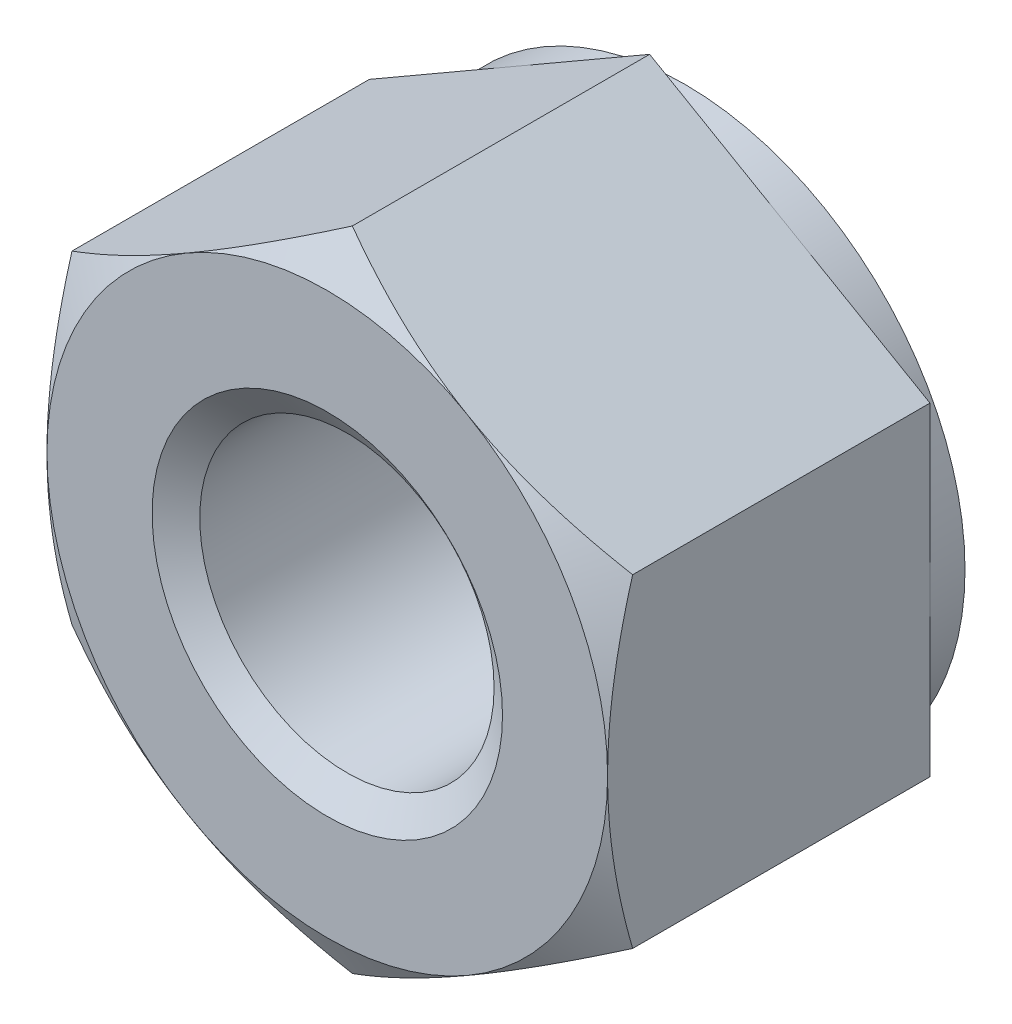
ISO-10303-21;
HEADER;
FILE_DESCRIPTION(('STEP AP214'),'2;1');
FILE_NAME('part.step','',(''),(''),'','','');
FILE_SCHEMA(('AUTOMOTIVE_DESIGN { 1 0 10303 214 1 1 1 1 }'));
ENDSEC;
DATA;
#1=APPLICATION_CONTEXT('core data for automotive mechanical design processes');
#2=APPLICATION_PROTOCOL_DEFINITION('international standard','automotive_design',2000,#1);
#3=PRODUCT_CONTEXT('',#1,'mechanical');
#4=PRODUCT('Part','Part','',(#3));
#5=PRODUCT_RELATED_PRODUCT_CATEGORY('part','',(#4));
#6=PRODUCT_DEFINITION_FORMATION('','',#4);
#7=PRODUCT_DEFINITION_CONTEXT('part definition',#1,'design');
#8=PRODUCT_DEFINITION('design','',#6,#7);
#9=PRODUCT_DEFINITION_SHAPE('','',#8);
#10=(LENGTH_UNIT() NAMED_UNIT(*) SI_UNIT(.MILLI.,.METRE.));
#11=(NAMED_UNIT(*) PLANE_ANGLE_UNIT() SI_UNIT($,.RADIAN.));
#12=(NAMED_UNIT(*) SI_UNIT($,.STERADIAN.) SOLID_ANGLE_UNIT());
#13=UNCERTAINTY_MEASURE_WITH_UNIT(LENGTH_MEASURE(1.E-05),#10,'distance_accuracy_value','');
#14=(GEOMETRIC_REPRESENTATION_CONTEXT(3) GLOBAL_UNCERTAINTY_ASSIGNED_CONTEXT((#13)) GLOBAL_UNIT_ASSIGNED_CONTEXT((#10,
#11,#12)) REPRESENTATION_CONTEXT('',''));
#15=CARTESIAN_POINT('',(0.,0.,0.));
#16=DIRECTION('',(0.,0.,1.));
#17=DIRECTION('',(1.,0.,0.));
#18=AXIS2_PLACEMENT_3D('',#15,#16,#17);
#19=CARTESIAN_POINT('',(0.,0.,-5.1));
#20=DIRECTION('',(0.,0.,1.));
#21=DIRECTION('',(1.,0.,0.));
#22=AXIS2_PLACEMENT_3D('',#19,#20,#21);
#23=CYLINDRICAL_SURFACE('',#22,2.1);
#24=CARTESIAN_POINT('',(0.,0.,-0.28008301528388));
#25=DIRECTION('',(0.,0.,1.));
#26=DIRECTION('',(1.,0.,0.));
#27=AXIS2_PLACEMENT_3D('',#24,#25,#26);
#28=CIRCLE('',#27,2.1);
#29=CARTESIAN_POINT('',(2.1,0.,-0.28008301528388));
#30=VERTEX_POINT('',#29);
#31=EDGE_CURVE('E153',#30,#30,#28,.F.);
#32=ORIENTED_EDGE('',*,*,#31,.F.);
#33=EDGE_LOOP('',(#32));
#34=FACE_BOUND('',#33,.T.);
#35=CARTESIAN_POINT('',(0.,0.,-4.79451698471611));
#36=DIRECTION('',(0.,0.,-1.));
#37=DIRECTION('',(-1.,0.,0.));
#38=AXIS2_PLACEMENT_3D('',#35,#36,#37);
#39=CIRCLE('',#38,2.1);
#40=CARTESIAN_POINT('',(-2.1,0.,-4.79451698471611));
#41=VERTEX_POINT('',#40);
#42=EDGE_CURVE('E41',#41,#41,#39,.F.);
#43=ORIENTED_EDGE('',*,*,#42,.F.);
#44=EDGE_LOOP('',(#43));
#45=FACE_BOUND('',#44,.T.);
#46=ADVANCED_FACE('F36',(#34,#45),#23,.F.);
#47=CARTESIAN_POINT('',(0.,4.61880215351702,-5.1));
#48=DIRECTION('',(-0.500000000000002,0.866025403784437,0.));
#49=DIRECTION('',(-0.866025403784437,-0.500000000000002,0.));
#50=AXIS2_PLACEMENT_3D('',#47,#48,#49);
#51=PLANE('',#50);
#52=DIRECTION('',(0.,0.,1.));
#53=VECTOR('',#52,1.);
#54=CARTESIAN_POINT('',(-4.,2.3094010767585,-5.1));
#55=LINE('',#54,#53);
#56=CARTESIAN_POINT('',(-4.,2.3094010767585,-4.6));
#57=VERTEX_POINT('',#56);
#58=CARTESIAN_POINT('',(-4.,2.3094010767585,-0.357265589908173));
#59=VERTEX_POINT('',#58);
#60=EDGE_CURVE('E294',#57,#59,#55,.T.);
#61=ORIENTED_EDGE('',*,*,#60,.T.);
#62=CARTESIAN_POINT('',(-4.0002,2.30928560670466,-0.357332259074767));
#63=CARTESIAN_POINT('',(-3.82442084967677,2.4107717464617,-0.298717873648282));
#64=CARTESIAN_POINT('',(-3.64712438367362,2.51313390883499,-0.245410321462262));
#65=CARTESIAN_POINT('',(-3.28946140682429,2.71963072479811,-0.152361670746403));
#66=CARTESIAN_POINT('',(-3.10908854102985,2.82376904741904,-0.112653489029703));
#67=CARTESIAN_POINT('',(-2.75057818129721,3.03075510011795,-0.0508422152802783));
#68=CARTESIAN_POINT('',(-2.57249584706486,3.13357098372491,-0.028327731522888));
#69=CARTESIAN_POINT('',(-2.21549328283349,3.33968651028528,-0.00145062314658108));
#70=CARTESIAN_POINT('',(-2.0365743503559,3.44298540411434,0.00293425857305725));
#71=CARTESIAN_POINT('',(-1.70225715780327,3.63600352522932,-0.0061900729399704));
#72=CARTESIAN_POINT('',(-1.54680884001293,3.72575165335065,-0.0174589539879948));
#73=CARTESIAN_POINT('',(-1.23692494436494,3.90466320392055,-0.0531739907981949));
#74=CARTESIAN_POINT('',(-1.08249043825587,3.99382600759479,-0.0776323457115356));
#75=CARTESIAN_POINT('',(-0.771967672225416,4.17310641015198,-0.138776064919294));
#76=CARTESIAN_POINT('',(-0.61591871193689,4.26320131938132,-0.175720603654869));
#77=CARTESIAN_POINT('',(-0.306148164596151,4.44204742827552,-0.259570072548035));
#78=CARTESIAN_POINT('',(-0.15242260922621,4.53080091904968,-0.306455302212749));
#79=CARTESIAN_POINT('',(0.000200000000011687,4.61891762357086,-0.357332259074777));
#80=B_SPLINE_CURVE_WITH_KNOTS('',3,(#62,#63,#64,#65,#66,#67,#68,#69,#70,#71,#72,#73,#74,#75,#76,
#77,#78,#79),.UNSPECIFIED.,.F.,.F.,(4,2,2,2,2,2,2,2,4),(0.,0.634047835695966,1.26961969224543,
1.88946157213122,2.50854226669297,3.04757825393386,3.58711366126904,4.13861653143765,
4.68903648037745),.UNSPECIFIED.);
#81=CARTESIAN_POINT('',(-2.00000000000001,3.46410161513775,0.));
#82=VERTEX_POINT('',#81);
#83=EDGE_CURVE('E60',#59,#82,#80,.T.);
#84=ORIENTED_EDGE('',*,*,#83,.T.);
#85=CARTESIAN_POINT('',(0.,4.61880215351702,-0.357265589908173));
#86=VERTEX_POINT('',#85);
#87=EDGE_CURVE('E167',#82,#86,#80,.T.);
#88=ORIENTED_EDGE('',*,*,#87,.T.);
#89=DIRECTION('',(0.,0.,1.));
#90=VECTOR('',#89,1.);
#91=CARTESIAN_POINT('',(0.,4.61880215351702,-5.1));
#92=LINE('',#91,#90);
#93=CARTESIAN_POINT('',(0.,4.61880215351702,-4.6));
#94=VERTEX_POINT('',#93);
#95=EDGE_CURVE('E282',#94,#86,#92,.T.);
#96=ORIENTED_EDGE('',*,*,#95,.F.);
#97=DIRECTION('',(-0.866025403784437,-0.500000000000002,0.));
#98=VECTOR('',#97,1.);
#99=CARTESIAN_POINT('',(0.,4.61880215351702,-4.6));
#100=LINE('',#99,#98);
#101=CARTESIAN_POINT('',(-2.00000000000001,3.46410161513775,-4.6));
#102=VERTEX_POINT('',#101);
#103=EDGE_CURVE('E270',#94,#102,#100,.T.);
#104=ORIENTED_EDGE('',*,*,#103,.T.);
#105=EDGE_CURVE('E266',#102,#57,#100,.T.);
#106=ORIENTED_EDGE('',*,*,#105,.T.);
#107=EDGE_LOOP('',(#61,#84,#88,#96,#104,#106));
#108=FACE_BOUND('',#107,.T.);
#109=ADVANCED_FACE('F38',(#108),#51,.T.);
#110=CARTESIAN_POINT('',(4.,2.30940107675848,-5.1));
#111=DIRECTION('',(0.500000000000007,0.866025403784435,0.));
#112=DIRECTION('',(-0.866025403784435,0.500000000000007,0.));
#113=AXIS2_PLACEMENT_3D('',#110,#111,#112);
#114=PLANE('',#113);
#115=ORIENTED_EDGE('',*,*,#95,.T.);
#116=CARTESIAN_POINT('',(-0.00019999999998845,4.61891762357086,-0.357332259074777));
#117=CARTESIAN_POINT('',(0.175579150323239,4.51743148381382,-0.298717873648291));
#118=CARTESIAN_POINT('',(0.352875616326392,4.41506932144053,-0.245410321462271));
#119=CARTESIAN_POINT('',(0.710538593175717,4.2085725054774,-0.152361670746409));
#120=CARTESIAN_POINT('',(0.890911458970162,4.10443418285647,-0.112653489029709));
#121=CARTESIAN_POINT('',(1.2494218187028,3.89744813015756,-0.0508422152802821));
#122=CARTESIAN_POINT('',(1.42750415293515,3.79463224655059,-0.0283277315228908));
#123=CARTESIAN_POINT('',(1.78450671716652,3.58851671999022,-0.00145062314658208));
#124=CARTESIAN_POINT('',(1.96342564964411,3.48521782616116,0.00293425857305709));
#125=CARTESIAN_POINT('',(2.29774284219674,3.29219970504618,-0.00619007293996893));
#126=CARTESIAN_POINT('',(2.45319115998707,3.20245157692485,-0.0174589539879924));
#127=CARTESIAN_POINT('',(2.76307505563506,3.02354002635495,-0.0531739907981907));
#128=CARTESIAN_POINT('',(2.91750956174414,2.93437722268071,-0.0776323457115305));
#129=CARTESIAN_POINT('',(3.22803232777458,2.75509682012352,-0.138776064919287));
#130=CARTESIAN_POINT('',(3.38408128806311,2.66500191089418,-0.175720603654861));
#131=CARTESIAN_POINT('',(3.69385183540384,2.48615580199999,-0.259570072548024));
#132=CARTESIAN_POINT('',(3.84757739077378,2.39740231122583,-0.306455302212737));
#133=CARTESIAN_POINT('',(4.0002,2.30928560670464,-0.357332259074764));
#134=B_SPLINE_CURVE_WITH_KNOTS('',3,(#116,#117,#118,#119,#120,#121,#122,#123,#124,#125,#126,
#127,#128,#129,#130,#131,#132,#133),.UNSPECIFIED.,.F.,.F.,(4,2,2,2,2,2,2,2,4),(0.,
0.634047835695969,1.26961969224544,1.88946157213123,2.50854226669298,3.04757825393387,
3.58711366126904,4.13861653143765,4.68903648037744),.UNSPECIFIED.);
#135=CARTESIAN_POINT('',(2.00000000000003,3.46410161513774,0.));
#136=VERTEX_POINT('',#135);
#137=EDGE_CURVE('E164',#86,#136,#134,.T.);
#138=ORIENTED_EDGE('',*,*,#137,.T.);
#139=CARTESIAN_POINT('',(4.,2.30940107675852,-0.357265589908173));
#140=VERTEX_POINT('',#139);
#141=EDGE_CURVE('E147',#136,#140,#134,.T.);
#142=ORIENTED_EDGE('',*,*,#141,.T.);
#143=DIRECTION('',(0.,0.,1.));
#144=VECTOR('',#143,1.);
#145=CARTESIAN_POINT('',(4.,2.30940107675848,-5.1));
#146=LINE('',#145,#144);
#147=CARTESIAN_POINT('',(4.,2.30940107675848,-4.6));
#148=VERTEX_POINT('',#147);
#149=EDGE_CURVE('E163',#148,#140,#146,.T.);
#150=ORIENTED_EDGE('',*,*,#149,.F.);
#151=DIRECTION('',(-0.866025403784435,0.500000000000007,0.));
#152=VECTOR('',#151,1.);
#153=CARTESIAN_POINT('',(4.,2.30940107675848,-4.6));
#154=LINE('',#153,#152);
#155=CARTESIAN_POINT('',(2.00000000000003,3.46410161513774,-4.6));
#156=VERTEX_POINT('',#155);
#157=EDGE_CURVE('E278',#148,#156,#154,.T.);
#158=ORIENTED_EDGE('',*,*,#157,.T.);
#159=EDGE_CURVE('E274',#156,#94,#154,.T.);
#160=ORIENTED_EDGE('',*,*,#159,.T.);
#161=EDGE_LOOP('',(#115,#138,#142,#150,#158,#160));
#162=FACE_BOUND('',#161,.T.);
#163=ADVANCED_FACE('F241',(#162),#114,.T.);
#164=CARTESIAN_POINT('',(4.,2.30940107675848,-5.1));
#165=DIRECTION('',(-1.,0.,0.));
#166=DIRECTION('',(0.,0.,1.));
#167=AXIS2_PLACEMENT_3D('',#164,#165,#166);
#168=PLANE('',#167);
#169=CARTESIAN_POINT('',(4.,-6.12487198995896,-1.91410682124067));
#170=CARTESIAN_POINT('',(4.,-5.9492493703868,-1.82923627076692));
#171=CARTESIAN_POINT('',(4.,-5.7732115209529,-1.74520940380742));
#172=CARTESIAN_POINT('',(4.,-5.42008084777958,-1.57932514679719));
#173=CARTESIAN_POINT('',(4.,-5.24298784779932,-1.49746813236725));
#174=CARTESIAN_POINT('',(4.,-4.88656571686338,-1.33597446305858));
#175=CARTESIAN_POINT('',(4.,-4.70722958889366,-1.25635319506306));
#176=CARTESIAN_POINT('',(4.,-4.34708334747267,-1.10053058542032));
#177=CARTESIAN_POINT('',(4.,-4.16627331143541,-1.02432906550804));
#178=CARTESIAN_POINT('',(4.,-3.80064706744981,-0.87535065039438));
#179=CARTESIAN_POINT('',(4.,-3.61580892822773,-0.802627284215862));
#180=CARTESIAN_POINT('',(4.,-3.24395246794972,-0.662876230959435));
#181=CARTESIAN_POINT('',(4.,-3.05693390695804,-0.595849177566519));
#182=CARTESIAN_POINT('',(4.,-2.68080318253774,-0.469291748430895));
#183=CARTESIAN_POINT('',(4.,-2.49169643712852,-0.40974543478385));
#184=CARTESIAN_POINT('',(4.,-2.11079454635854,-0.300083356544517));
#185=CARTESIAN_POINT('',(4.,-1.91900027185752,-0.249964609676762));
#186=CARTESIAN_POINT('',(4.,-1.53259232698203,-0.16159079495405));
#187=CARTESIAN_POINT('',(4.,-1.33797792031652,-0.123338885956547));
#188=CARTESIAN_POINT('',(4.,-0.946402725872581,-0.0612742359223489));
#189=CARTESIAN_POINT('',(4.,-0.7494419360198,-0.0374615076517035));
#190=CARTESIAN_POINT('',(4.,-0.355451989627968,-0.00638181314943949));
#191=CARTESIAN_POINT('',(4.,-0.158431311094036,0.000989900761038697));
#192=CARTESIAN_POINT('',(4.,0.235472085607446,-0.00120406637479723));
#193=CARTESIAN_POINT('',(4.,0.432354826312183,-0.0107653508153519));
#194=CARTESIAN_POINT('',(4.,0.768560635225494,-0.0408787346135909));
#195=CARTESIAN_POINT('',(4.,0.908254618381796,-0.0575092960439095));
#196=CARTESIAN_POINT('',(4.,1.18656349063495,-0.0982134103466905));
#197=CARTESIAN_POINT('',(4.,1.32517820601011,-0.122288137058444));
#198=CARTESIAN_POINT('',(4.,1.73929045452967,-0.204415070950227));
#199=CARTESIAN_POINT('',(4.,2.01284690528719,-0.272348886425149));
#200=CARTESIAN_POINT('',(4.,2.42218253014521,-0.389516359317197));
#201=CARTESIAN_POINT('',(4.,2.56009536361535,-0.43171394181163));
#202=CARTESIAN_POINT('',(4.,2.834481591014,-0.520284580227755));
#203=CARTESIAN_POINT('',(4.,2.97095590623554,-0.566654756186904));
#204=CARTESIAN_POINT('',(4.,3.24189440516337,-0.662605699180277));
#205=CARTESIAN_POINT('',(4.,3.37636557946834,-0.71216692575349));
#206=CARTESIAN_POINT('',(4.,3.6442646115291,-0.814198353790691));
#207=CARTESIAN_POINT('',(4.,3.77769202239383,-0.866669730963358));
#208=CARTESIAN_POINT('',(4.,3.9106369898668,-0.920309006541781));
#209=B_SPLINE_CURVE_WITH_KNOTS('',3,(#169,#170,#171,#172,#173,#174,#175,#176,#177,#178,#179,
#180,#181,#182,#183,#184,#185,#186,#187,#188,#189,#190,#191,#192,#193,#194,#195,#196,#197,#198,
#199,#200,#201,#202,#203,#204,#205,#206,#207,#208),.UNSPECIFIED.,.F.,.F.,(4,2,2,2,2,2,2,2,2,2,2,
2,2,2,2,2,2,2,2,4),(0.,0.585171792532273,1.17044423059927,1.7590659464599,2.34765694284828,
2.94347400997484,3.5393572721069,4.13394864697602,4.72835161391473,5.32291267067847,
5.91747425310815,6.50823685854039,7.09884609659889,7.52068140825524,7.94258327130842,
8.78701491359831,9.2196528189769,9.65199437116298,10.0819024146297,10.5119854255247),.UNSPECIFIED.);
#210=CARTESIAN_POINT('',(3.99999999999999,-2.30940107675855,-0.357265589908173));
#211=VERTEX_POINT('',#210);
#212=CARTESIAN_POINT('',(4.,0.,0.));
#213=VERTEX_POINT('',#212);
#214=EDGE_CURVE('E128',#211,#213,#209,.T.);
#215=ORIENTED_EDGE('',*,*,#214,.F.);
#216=DIRECTION('',(0.,0.,1.));
#217=VECTOR('',#216,1.);
#218=CARTESIAN_POINT('',(4.,-2.30940107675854,-5.1));
#219=LINE('',#218,#217);
#220=CARTESIAN_POINT('',(4.,-2.30940107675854,-4.6));
#221=VERTEX_POINT('',#220);
#222=EDGE_CURVE('E287',#221,#211,#219,.T.);
#223=ORIENTED_EDGE('',*,*,#222,.F.);
#224=DIRECTION('',(0.,-1.,0.));
#225=VECTOR('',#224,1.);
#226=CARTESIAN_POINT('',(4.,2.30940107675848,-4.6));
#227=LINE('',#226,#225);
#228=CARTESIAN_POINT('',(4.,0.,-4.6));
#229=VERTEX_POINT('',#228);
#230=EDGE_CURVE('E279',#229,#221,#227,.T.);
#231=ORIENTED_EDGE('',*,*,#230,.F.);
#232=EDGE_CURVE('E281',#148,#229,#227,.T.);
#233=ORIENTED_EDGE('',*,*,#232,.F.);
#234=ORIENTED_EDGE('',*,*,#149,.T.);
#235=EDGE_CURVE('E141',#213,#140,#209,.T.);
#236=ORIENTED_EDGE('',*,*,#235,.F.);
#237=EDGE_LOOP('',(#215,#223,#231,#233,#234,#236));
#238=FACE_BOUND('',#237,.T.);
#239=ADVANCED_FACE('F160',(#238),#168,.F.);
#240=CARTESIAN_POINT('',(0.,-4.61880215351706,-5.1));
#241=DIRECTION('',(0.500000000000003,-0.866025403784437,0.));
#242=DIRECTION('',(0.866025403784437,0.500000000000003,0.));
#243=AXIS2_PLACEMENT_3D('',#240,#241,#242);
#244=PLANE('',#243);
#245=ORIENTED_EDGE('',*,*,#222,.T.);
#246=CARTESIAN_POINT('',(4.0002,-2.3092856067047,-0.357332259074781));
#247=CARTESIAN_POINT('',(3.82442084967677,-2.41077174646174,-0.298717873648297));
#248=CARTESIAN_POINT('',(3.64712438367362,-2.51313390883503,-0.245410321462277));
#249=CARTESIAN_POINT('',(3.28946140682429,-2.71963072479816,-0.152361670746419));
#250=CARTESIAN_POINT('',(3.10908854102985,-2.82376904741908,-0.112653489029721));
#251=CARTESIAN_POINT('',(2.75057818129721,-3.03075510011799,-0.0508422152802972));
#252=CARTESIAN_POINT('',(2.57249584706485,-3.13357098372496,-0.028327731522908));
#253=CARTESIAN_POINT('',(2.21549328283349,-3.33968651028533,-0.00145062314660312));
#254=CARTESIAN_POINT('',(2.03657435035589,-3.44298540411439,0.00293425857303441));
#255=CARTESIAN_POINT('',(1.70225715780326,-3.63600352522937,-0.00619007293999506));
#256=CARTESIAN_POINT('',(1.54680884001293,-3.7257516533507,-0.0174589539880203));
#257=CARTESIAN_POINT('',(1.23692494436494,-3.9046632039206,-0.0531739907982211));
#258=CARTESIAN_POINT('',(1.08249043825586,-3.99382600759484,-0.0776323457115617));
#259=CARTESIAN_POINT('',(0.771967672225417,-4.17310641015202,-0.13877606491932));
#260=CARTESIAN_POINT('',(0.615918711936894,-4.26320131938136,-0.175720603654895));
#261=CARTESIAN_POINT('',(0.306148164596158,-4.44204742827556,-0.25957007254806));
#262=CARTESIAN_POINT('',(0.152422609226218,-4.53080091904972,-0.306455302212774));
#263=CARTESIAN_POINT('',(-0.000200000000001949,-4.6189176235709,-0.357332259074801));
#264=B_SPLINE_CURVE_WITH_KNOTS('',3,(#246,#247,#248,#249,#250,#251,#252,#253,#254,#255,#256,
#257,#258,#259,#260,#261,#262,#263),.UNSPECIFIED.,.F.,.F.,(4,2,2,2,2,2,2,2,4),(0.,
0.63404783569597,1.26961969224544,1.88946157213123,2.50854226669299,3.04757825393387,
3.58711366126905,4.13861653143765,4.68903648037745),.UNSPECIFIED.);
#265=CARTESIAN_POINT('',(2.00000000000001,-3.46410161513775,0.));
#266=VERTEX_POINT('',#265);
#267=EDGE_CURVE('E135',#211,#266,#264,.T.);
#268=ORIENTED_EDGE('',*,*,#267,.T.);
#269=CARTESIAN_POINT('',(0.,-4.61880215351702,-0.357265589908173));
#270=VERTEX_POINT('',#269);
#271=EDGE_CURVE('E175',#266,#270,#264,.T.);
#272=ORIENTED_EDGE('',*,*,#271,.T.);
#273=DIRECTION('',(0.,0.,1.));
#274=VECTOR('',#273,1.);
#275=CARTESIAN_POINT('',(0.,-4.61880215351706,-5.1));
#276=LINE('',#275,#274);
#277=CARTESIAN_POINT('',(0.,-4.61880215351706,-4.6));
#278=VERTEX_POINT('',#277);
#279=EDGE_CURVE('E289',#278,#270,#276,.T.);
#280=ORIENTED_EDGE('',*,*,#279,.F.);
#281=DIRECTION('',(0.866025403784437,0.500000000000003,0.));
#282=VECTOR('',#281,1.);
#283=CARTESIAN_POINT('',(0.,-4.61880215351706,-4.6));
#284=LINE('',#283,#282);
#285=CARTESIAN_POINT('',(2.00000000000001,-3.46410161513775,-4.6));
#286=VERTEX_POINT('',#285);
#287=EDGE_CURVE('E271',#278,#286,#284,.T.);
#288=ORIENTED_EDGE('',*,*,#287,.T.);
#289=EDGE_CURVE('E275',#286,#221,#284,.T.);
#290=ORIENTED_EDGE('',*,*,#289,.T.);
#291=EDGE_LOOP('',(#245,#268,#272,#280,#288,#290));
#292=FACE_BOUND('',#291,.T.);
#293=ADVANCED_FACE('F222',(#292),#244,.T.);
#294=CARTESIAN_POINT('',(-4.,-2.30940107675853,-5.1));
#295=DIRECTION('',(-0.500000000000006,-0.866025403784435,0.));
#296=DIRECTION('',(0.866025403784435,-0.500000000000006,0.));
#297=AXIS2_PLACEMENT_3D('',#294,#295,#296);
#298=PLANE('',#297);
#299=ORIENTED_EDGE('',*,*,#279,.T.);
#300=CARTESIAN_POINT('',(0.000199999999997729,-4.6189176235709,-0.357332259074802));
#301=CARTESIAN_POINT('',(-0.175579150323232,-4.51743148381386,-0.298717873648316));
#302=CARTESIAN_POINT('',(-0.352875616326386,-4.41506932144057,-0.245410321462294));
#303=CARTESIAN_POINT('',(-0.710538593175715,-4.20857250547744,-0.152361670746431));
#304=CARTESIAN_POINT('',(-0.890911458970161,-4.10443418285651,-0.112653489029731));
#305=CARTESIAN_POINT('',(-1.2494218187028,-3.8974481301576,-0.0508422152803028));
#306=CARTESIAN_POINT('',(-1.42750415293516,-3.79463224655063,-0.0283277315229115));
#307=CARTESIAN_POINT('',(-1.78450671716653,-3.58851671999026,-0.00145062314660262));
#308=CARTESIAN_POINT('',(-1.96342564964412,-3.4852178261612,0.0029342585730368));
#309=CARTESIAN_POINT('',(-2.29774284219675,-3.29219970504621,-0.00619007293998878));
#310=CARTESIAN_POINT('',(-2.45319115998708,-3.20245157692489,-0.0174589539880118));
#311=CARTESIAN_POINT('',(-2.76307505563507,-3.02354002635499,-0.0531739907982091));
#312=CARTESIAN_POINT('',(-2.91750956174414,-2.93437722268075,-0.0776323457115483));
#313=CARTESIAN_POINT('',(-3.22803232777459,-2.75509682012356,-0.138776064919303));
#314=CARTESIAN_POINT('',(-3.38408128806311,-2.66500191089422,-0.175720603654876));
#315=CARTESIAN_POINT('',(-3.69385183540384,-2.48615580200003,-0.259570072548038));
#316=CARTESIAN_POINT('',(-3.84757739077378,-2.39740231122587,-0.30645530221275));
#317=CARTESIAN_POINT('',(-4.0002,-2.30928560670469,-0.357332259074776));
#318=B_SPLINE_CURVE_WITH_KNOTS('',3,(#300,#301,#302,#303,#304,#305,#306,#307,#308,#309,#310,
#311,#312,#313,#314,#315,#316,#317),.UNSPECIFIED.,.F.,.F.,(4,2,2,2,2,2,2,2,4),(0.,
0.634047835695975,1.26961969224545,1.88946157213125,2.508542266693,3.04757825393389,
3.58711366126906,4.13861653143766,4.68903648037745),.UNSPECIFIED.);
#319=CARTESIAN_POINT('',(-2.00000000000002,-3.46410161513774,0.));
#320=VERTEX_POINT('',#319);
#321=EDGE_CURVE('E216',#270,#320,#318,.T.);
#322=ORIENTED_EDGE('',*,*,#321,.T.);
#323=CARTESIAN_POINT('',(-4.,-2.30940107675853,-0.357265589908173));
#324=VERTEX_POINT('',#323);
#325=EDGE_CURVE('E208',#320,#324,#318,.T.);
#326=ORIENTED_EDGE('',*,*,#325,.T.);
#327=DIRECTION('',(0.,0.,1.));
#328=VECTOR('',#327,1.);
#329=CARTESIAN_POINT('',(-4.,-2.30940107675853,-5.1));
#330=LINE('',#329,#328);
#331=CARTESIAN_POINT('',(-4.,-2.30940107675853,-4.6));
#332=VERTEX_POINT('',#331);
#333=EDGE_CURVE('E292',#332,#324,#330,.T.);
#334=ORIENTED_EDGE('',*,*,#333,.F.);
#335=DIRECTION('',(0.866025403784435,-0.500000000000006,0.));
#336=VECTOR('',#335,1.);
#337=CARTESIAN_POINT('',(-4.,-2.30940107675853,-4.6));
#338=LINE('',#337,#336);
#339=CARTESIAN_POINT('',(-2.00000000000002,-3.46410161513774,-4.6));
#340=VERTEX_POINT('',#339);
#341=EDGE_CURVE('E261',#332,#340,#338,.T.);
#342=ORIENTED_EDGE('',*,*,#341,.T.);
#343=EDGE_CURVE('E267',#340,#278,#338,.T.);
#344=ORIENTED_EDGE('',*,*,#343,.T.);
#345=EDGE_LOOP('',(#299,#322,#326,#334,#342,#344));
#346=FACE_BOUND('',#345,.T.);
#347=ADVANCED_FACE('F218',(#346),#298,.T.);
#348=CARTESIAN_POINT('',(-4.,2.3094010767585,-5.1));
#349=DIRECTION('',(-1.,0.,0.));
#350=DIRECTION('',(0.,0.,1.));
#351=AXIS2_PLACEMENT_3D('',#348,#349,#350);
#352=PLANE('',#351);
#353=ORIENTED_EDGE('',*,*,#333,.T.);
#354=CARTESIAN_POINT('',(-4.,-6.12487198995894,-1.91410682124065));
#355=CARTESIAN_POINT('',(-4.,-5.94924937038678,-1.82923627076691));
#356=CARTESIAN_POINT('',(-4.,-5.77321152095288,-1.74520940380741));
#357=CARTESIAN_POINT('',(-4.,-5.42008084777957,-1.57932514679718));
#358=CARTESIAN_POINT('',(-4.,-5.2429878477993,-1.49746813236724));
#359=CARTESIAN_POINT('',(-4.,-4.88656571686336,-1.33597446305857));
#360=CARTESIAN_POINT('',(-4.,-4.70722958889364,-1.25635319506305));
#361=CARTESIAN_POINT('',(-4.,-4.34708334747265,-1.10053058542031));
#362=CARTESIAN_POINT('',(-4.,-4.16627331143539,-1.02432906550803));
#363=CARTESIAN_POINT('',(-4.,-3.80064706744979,-0.875350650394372));
#364=CARTESIAN_POINT('',(-4.,-3.61580892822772,-0.802627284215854));
#365=CARTESIAN_POINT('',(-4.,-3.2439524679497,-0.662876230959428));
#366=CARTESIAN_POINT('',(-4.,-3.05693390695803,-0.595849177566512));
#367=CARTESIAN_POINT('',(-4.,-2.68080318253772,-0.469291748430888));
#368=CARTESIAN_POINT('',(-4.,-2.4916964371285,-0.409745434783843));
#369=CARTESIAN_POINT('',(-4.,-2.11079454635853,-0.300083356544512));
#370=CARTESIAN_POINT('',(-4.,-1.9190002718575,-0.249964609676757));
#371=CARTESIAN_POINT('',(-4.,-1.53259232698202,-0.161590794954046));
#372=CARTESIAN_POINT('',(-4.,-1.33797792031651,-0.123338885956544));
#373=CARTESIAN_POINT('',(-4.,-0.94640272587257,-0.0612742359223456));
#374=CARTESIAN_POINT('',(-4.,-0.749441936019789,-0.0374615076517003));
#375=CARTESIAN_POINT('',(-4.,-0.355451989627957,-0.00638181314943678));
#376=CARTESIAN_POINT('',(-4.,-0.158431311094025,0.000989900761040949));
#377=CARTESIAN_POINT('',(-4.,0.235472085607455,-0.00120406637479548));
#378=CARTESIAN_POINT('',(-4.,0.432354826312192,-0.0107653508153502));
#379=CARTESIAN_POINT('',(-4.,0.768560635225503,-0.0408787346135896));
#380=CARTESIAN_POINT('',(-4.,0.908254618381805,-0.0575092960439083));
#381=CARTESIAN_POINT('',(-4.,1.18656349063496,-0.0982134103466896));
#382=CARTESIAN_POINT('',(-4.,1.32517820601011,-0.122288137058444));
#383=CARTESIAN_POINT('',(-4.,1.73929045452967,-0.204415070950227));
#384=CARTESIAN_POINT('',(-4.,2.0128469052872,-0.272348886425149));
#385=CARTESIAN_POINT('',(-4.,2.42218253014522,-0.389516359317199));
#386=CARTESIAN_POINT('',(-4.,2.56009536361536,-0.431713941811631));
#387=CARTESIAN_POINT('',(-4.,2.83448159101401,-0.520284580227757));
#388=CARTESIAN_POINT('',(-4.,2.97095590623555,-0.566654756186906));
#389=CARTESIAN_POINT('',(-4.,3.24189440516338,-0.662605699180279));
#390=CARTESIAN_POINT('',(-4.,3.37636557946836,-0.712166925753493));
#391=CARTESIAN_POINT('',(-4.,3.64426461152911,-0.814198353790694));
#392=CARTESIAN_POINT('',(-4.,3.77769202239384,-0.866669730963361));
#393=CARTESIAN_POINT('',(-4.,3.91063698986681,-0.920309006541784));
#394=B_SPLINE_CURVE_WITH_KNOTS('',3,(#354,#355,#356,#357,#358,#359,#360,#361,#362,#363,#364,
#365,#366,#367,#368,#369,#370,#371,#372,#373,#374,#375,#376,#377,#378,#379,#380,#381,#382,#383,
#384,#385,#386,#387,#388,#389,#390,#391,#392,#393),.UNSPECIFIED.,.F.,.F.,(4,2,2,2,2,2,2,2,2,2,2,
2,2,2,2,2,2,2,2,4),(0.,0.585171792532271,1.17044423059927,1.7590659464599,2.34765694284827,
2.94347400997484,3.5393572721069,4.13394864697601,4.72835161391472,5.32291267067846,
5.91747425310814,6.50823685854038,7.09884609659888,7.52068140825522,7.9425832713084,
8.7870149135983,9.21965281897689,9.65199437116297,10.0819024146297,10.5119854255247),.UNSPECIFIED.);
#395=CARTESIAN_POINT('',(-4.,0.,0.));
#396=VERTEX_POINT('',#395);
#397=EDGE_CURVE('E217',#324,#396,#394,.T.);
#398=ORIENTED_EDGE('',*,*,#397,.T.);
#399=EDGE_CURVE('E152',#396,#59,#394,.T.);
#400=ORIENTED_EDGE('',*,*,#399,.T.);
#401=ORIENTED_EDGE('',*,*,#60,.F.);
#402=DIRECTION('',(0.,-1.,0.));
#403=VECTOR('',#402,1.);
#404=CARTESIAN_POINT('',(-4.,2.3094010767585,-4.6));
#405=LINE('',#404,#403);
#406=CARTESIAN_POINT('',(-4.,0.,-4.6));
#407=VERTEX_POINT('',#406);
#408=EDGE_CURVE('E301',#57,#407,#405,.T.);
#409=ORIENTED_EDGE('',*,*,#408,.T.);
#410=EDGE_CURVE('E299',#407,#332,#405,.T.);
#411=ORIENTED_EDGE('',*,*,#410,.T.);
#412=EDGE_LOOP('',(#353,#398,#400,#401,#409,#411));
#413=FACE_BOUND('',#412,.T.);
#414=ADVANCED_FACE('F221',(#413),#352,.T.);
#415=CARTESIAN_POINT('',(0.,4.61880215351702,0.));
#416=DIRECTION('',(0.,0.,-1.));
#417=DIRECTION('',(-1.,0.,0.));
#418=AXIS2_PLACEMENT_3D('',#415,#416,#417);
#419=PLANE('',#418);
#420=CARTESIAN_POINT('',(0.,0.,0.));
#421=DIRECTION('',(0.,0.,1.));
#422=DIRECTION('',(1.,0.,0.));
#423=AXIS2_PLACEMENT_3D('',#420,#421,#422);
#424=CIRCLE('',#423,2.5);
#425=CARTESIAN_POINT('',(2.5,0.,0.));
#426=VERTEX_POINT('',#425);
#427=EDGE_CURVE('E304',#426,#426,#424,.T.);
#428=ORIENTED_EDGE('',*,*,#427,.F.);
#429=EDGE_LOOP('',(#428));
#430=FACE_BOUND('',#429,.T.);
#431=CARTESIAN_POINT('',(0.,0.,0.));
#432=DIRECTION('',(0.,0.,-1.));
#433=DIRECTION('',(-1.,0.,0.));
#434=AXIS2_PLACEMENT_3D('',#431,#432,#433);
#435=CIRCLE('',#434,4.);
#436=EDGE_CURVE('E48',#82,#396,#435,.F.);
#437=ORIENTED_EDGE('',*,*,#436,.T.);
#438=EDGE_CURVE('E12',#396,#320,#435,.F.);
#439=ORIENTED_EDGE('',*,*,#438,.T.);
#440=EDGE_CURVE('E46',#320,#266,#435,.F.);
#441=ORIENTED_EDGE('',*,*,#440,.T.);
#442=EDGE_CURVE('E132',#266,#213,#435,.F.);
#443=ORIENTED_EDGE('',*,*,#442,.T.);
#444=CARTESIAN_POINT('',(0.,0.,0.));
#445=DIRECTION('',(0.,0.,1.));
#446=DIRECTION('',(1.,0.,0.));
#447=AXIS2_PLACEMENT_3D('',#444,#445,#446);
#448=CIRCLE('',#447,4.);
#449=EDGE_CURVE('E144',#213,#136,#448,.T.);
#450=ORIENTED_EDGE('',*,*,#449,.T.);
#451=EDGE_CURVE('E158',#136,#82,#435,.F.);
#452=ORIENTED_EDGE('',*,*,#451,.T.);
#453=EDGE_LOOP('',(#437,#439,#441,#443,#450,#452));
#454=FACE_BOUND('',#453,.T.);
#455=ADVANCED_FACE('F156',(#430,#454),#419,.F.);
#456=CARTESIAN_POINT('',(0.,4.61880215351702,-5.1));
#457=DIRECTION('',(0.,0.,-1.));
#458=DIRECTION('',(-1.,0.,0.));
#459=AXIS2_PLACEMENT_3D('',#456,#457,#458);
#460=PLANE('',#459);
#461=CARTESIAN_POINT('',(0.,0.,-5.1));
#462=DIRECTION('',(0.,0.,-1.));
#463=DIRECTION('',(-1.,0.,0.));
#464=AXIS2_PLACEMENT_3D('',#461,#462,#463);
#465=CIRCLE('',#464,2.5);
#466=CARTESIAN_POINT('',(-2.5,0.,-5.1));
#467=VERTEX_POINT('',#466);
#468=EDGE_CURVE('E305',#467,#467,#465,.F.);
#469=ORIENTED_EDGE('',*,*,#468,.T.);
#470=EDGE_LOOP('',(#469));
#471=FACE_BOUND('',#470,.T.);
#472=CARTESIAN_POINT('',(0.,0.,-5.1));
#473=DIRECTION('',(0.,0.,-1.));
#474=DIRECTION('',(-1.,0.,0.));
#475=AXIS2_PLACEMENT_3D('',#472,#473,#474);
#476=CIRCLE('',#475,4.);
#477=CARTESIAN_POINT('',(-4.,0.,-5.1));
#478=VERTEX_POINT('',#477);
#479=EDGE_CURVE('E285',#478,#478,#476,.F.);
#480=ORIENTED_EDGE('',*,*,#479,.F.);
#481=EDGE_LOOP('',(#480));
#482=FACE_BOUND('',#481,.T.);
#483=ADVANCED_FACE('F231',(#471,#482),#460,.T.);
#484=CARTESIAN_POINT('',(0.,14.618802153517,-4.6));
#485=DIRECTION('',(0.,0.,-1.));
#486=DIRECTION('',(-1.,0.,0.));
#487=AXIS2_PLACEMENT_3D('',#484,#485,#486);
#488=PLANE('',#487);
#489=ORIENTED_EDGE('',*,*,#232,.T.);
#490=CARTESIAN_POINT('',(0.,0.,-4.6));
#491=DIRECTION('',(0.,0.,1.));
#492=DIRECTION('',(1.,0.,0.));
#493=AXIS2_PLACEMENT_3D('',#490,#491,#492);
#494=CIRCLE('',#493,4.);
#495=EDGE_CURVE('E258',#229,#156,#494,.T.);
#496=ORIENTED_EDGE('',*,*,#495,.T.);
#497=ORIENTED_EDGE('',*,*,#157,.F.);
#498=EDGE_LOOP('',(#489,#496,#497));
#499=FACE_BOUND('',#498,.T.);
#500=ADVANCED_FACE('F248',(#499),#488,.T.);
#501=ORIENTED_EDGE('',*,*,#230,.T.);
#502=ORIENTED_EDGE('',*,*,#289,.F.);
#503=EDGE_CURVE('E263',#286,#229,#494,.T.);
#504=ORIENTED_EDGE('',*,*,#503,.T.);
#505=EDGE_LOOP('',(#501,#502,#504));
#506=FACE_BOUND('',#505,.T.);
#507=ADVANCED_FACE('F451',(#506),#488,.T.);
#508=EDGE_CURVE('E262',#156,#102,#494,.T.);
#509=ORIENTED_EDGE('',*,*,#508,.T.);
#510=ORIENTED_EDGE('',*,*,#103,.F.);
#511=ORIENTED_EDGE('',*,*,#159,.F.);
#512=EDGE_LOOP('',(#509,#510,#511));
#513=FACE_BOUND('',#512,.T.);
#514=ADVANCED_FACE('F442',(#513),#488,.T.);
#515=ORIENTED_EDGE('',*,*,#343,.F.);
#516=EDGE_CURVE('E515',#340,#286,#494,.T.);
#517=ORIENTED_EDGE('',*,*,#516,.T.);
#518=ORIENTED_EDGE('',*,*,#287,.F.);
#519=EDGE_LOOP('',(#515,#517,#518));
#520=FACE_BOUND('',#519,.T.);
#521=ADVANCED_FACE('F433',(#520),#488,.T.);
#522=EDGE_CURVE('E529',#102,#407,#494,.T.);
#523=ORIENTED_EDGE('',*,*,#522,.T.);
#524=ORIENTED_EDGE('',*,*,#408,.F.);
#525=ORIENTED_EDGE('',*,*,#105,.F.);
#526=EDGE_LOOP('',(#523,#524,#525));
#527=FACE_BOUND('',#526,.T.);
#528=ADVANCED_FACE('F417',(#527),#488,.T.);
#529=CARTESIAN_POINT('',(0.,0.,0.));
#530=DIRECTION('',(0.,0.,1.));
#531=DIRECTION('',(1.,0.,0.));
#532=AXIS2_PLACEMENT_3D('',#529,#530,#531);
#533=CYLINDRICAL_SURFACE('',#532,4.);
#534=ORIENTED_EDGE('',*,*,#479,.T.);
#535=EDGE_LOOP('',(#534));
#536=FACE_BOUND('',#535,.T.);
#537=ORIENTED_EDGE('',*,*,#508,.F.);
#538=ORIENTED_EDGE('',*,*,#495,.F.);
#539=ORIENTED_EDGE('',*,*,#503,.F.);
#540=ORIENTED_EDGE('',*,*,#516,.F.);
#541=EDGE_CURVE('E531',#407,#340,#494,.T.);
#542=ORIENTED_EDGE('',*,*,#541,.F.);
#543=ORIENTED_EDGE('',*,*,#522,.F.);
#544=EDGE_LOOP('',(#537,#538,#539,#540,#542,#543));
#545=FACE_BOUND('',#544,.T.);
#546=ADVANCED_FACE('F197',(#536,#545),#533,.T.);
#547=ORIENTED_EDGE('',*,*,#410,.F.);
#548=ORIENTED_EDGE('',*,*,#541,.T.);
#549=ORIENTED_EDGE('',*,*,#341,.F.);
#550=EDGE_LOOP('',(#547,#548,#549));
#551=FACE_BOUND('',#550,.T.);
#552=ADVANCED_FACE('F246',(#551),#488,.T.);
#553=CARTESIAN_POINT('',(0.,0.,0.));
#554=DIRECTION('',(0.,0.,-1.));
#555=DIRECTION('',(-1.,0.,0.));
#556=AXIS2_PLACEMENT_3D('',#553,#554,#555);
#557=CONICAL_SURFACE('',#556,4.,1.0471975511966);
#558=ORIENTED_EDGE('',*,*,#399,.F.);
#559=ORIENTED_EDGE('',*,*,#436,.F.);
#560=ORIENTED_EDGE('',*,*,#83,.F.);
#561=EDGE_LOOP('',(#558,#559,#560));
#562=FACE_BOUND('',#561,.T.);
#563=ADVANCED_FACE('F379',(#562),#557,.T.);
#564=ORIENTED_EDGE('',*,*,#451,.F.);
#565=ORIENTED_EDGE('',*,*,#137,.F.);
#566=ORIENTED_EDGE('',*,*,#87,.F.);
#567=EDGE_LOOP('',(#564,#565,#566));
#568=FACE_BOUND('',#567,.T.);
#569=ADVANCED_FACE('F195',(#568),#557,.T.);
#570=ORIENTED_EDGE('',*,*,#449,.F.);
#571=ORIENTED_EDGE('',*,*,#235,.T.);
#572=ORIENTED_EDGE('',*,*,#141,.F.);
#573=EDGE_LOOP('',(#570,#571,#572));
#574=FACE_BOUND('',#573,.T.);
#575=ADVANCED_FACE('F145',(#574),#557,.T.);
#576=ORIENTED_EDGE('',*,*,#214,.T.);
#577=ORIENTED_EDGE('',*,*,#442,.F.);
#578=ORIENTED_EDGE('',*,*,#267,.F.);
#579=EDGE_LOOP('',(#576,#577,#578));
#580=FACE_BOUND('',#579,.T.);
#581=ADVANCED_FACE('F130',(#580),#557,.T.);
#582=ORIENTED_EDGE('',*,*,#440,.F.);
#583=ORIENTED_EDGE('',*,*,#321,.F.);
#584=ORIENTED_EDGE('',*,*,#271,.F.);
#585=EDGE_LOOP('',(#582,#583,#584));
#586=FACE_BOUND('',#585,.T.);
#587=ADVANCED_FACE('F194',(#586),#557,.T.);
#588=ORIENTED_EDGE('',*,*,#438,.F.);
#589=ORIENTED_EDGE('',*,*,#397,.F.);
#590=ORIENTED_EDGE('',*,*,#325,.F.);
#591=EDGE_LOOP('',(#588,#589,#590));
#592=FACE_BOUND('',#591,.T.);
#593=ADVANCED_FACE('F188',(#592),#557,.T.);
#594=CARTESIAN_POINT('',(0.,0.,-0.308091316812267));
#595=DIRECTION('',(0.,0.,1.));
#596=DIRECTION('',(1.,0.,0.));
#597=AXIS2_PLACEMENT_3D('',#594,#595,#596);
#598=CONICAL_SURFACE('',#597,2.06,0.959931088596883);
#599=ORIENTED_EDGE('',*,*,#427,.T.);
#600=EDGE_LOOP('',(#599));
#601=FACE_BOUND('',#600,.T.);
#602=ORIENTED_EDGE('',*,*,#31,.T.);
#603=EDGE_LOOP('',(#602));
#604=FACE_BOUND('',#603,.T.);
#605=ADVANCED_FACE('F193',(#601,#604),#598,.F.);
#606=CARTESIAN_POINT('',(0.,0.,-5.0746));
#607=DIRECTION('',(0.,0.,-1.));
#608=DIRECTION('',(-1.,0.,0.));
#609=AXIS2_PLACEMENT_3D('',#606,#607,#608);
#610=CONICAL_SURFACE('',#609,2.5,0.959931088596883);
#611=CARTESIAN_POINT('',(0.,0.,-5.0746));
#612=DIRECTION('',(0.,0.,1.));
#613=DIRECTION('',(1.,0.,0.));
#614=AXIS2_PLACEMENT_3D('',#611,#612,#613);
#615=CIRCLE('',#614,2.5);
#616=CARTESIAN_POINT('',(2.5,0.,-5.0746));
#617=VERTEX_POINT('',#616);
#618=EDGE_CURVE('E307',#617,#617,#615,.T.);
#619=ORIENTED_EDGE('',*,*,#618,.F.);
#620=EDGE_LOOP('',(#619));
#621=FACE_BOUND('',#620,.T.);
#622=ORIENTED_EDGE('',*,*,#42,.T.);
#623=EDGE_LOOP('',(#622));
#624=FACE_BOUND('',#623,.T.);
#625=ADVANCED_FACE('F320',(#621,#624),#610,.F.);
#626=CARTESIAN_POINT('',(0.,0.,-25.0375057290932));
#627=DIRECTION('',(0.,0.,1.));
#628=DIRECTION('',(1.,0.,0.));
#629=AXIS2_PLACEMENT_3D('',#626,#627,#628);
#630=CYLINDRICAL_SURFACE('',#629,2.5);
#631=ORIENTED_EDGE('',*,*,#468,.F.);
#632=EDGE_LOOP('',(#631));
#633=FACE_BOUND('',#632,.T.);
#634=ORIENTED_EDGE('',*,*,#618,.T.);
#635=EDGE_LOOP('',(#634));
#636=FACE_BOUND('',#635,.T.);
#637=ADVANCED_FACE('F324',(#633,#636),#630,.F.);
#638=CLOSED_SHELL('',(#46,#109,#163,#239,#293,#347,#414,#455,#483,#500,#507,#514,#521,#528,#546,
#552,#563,#569,#575,#581,#587,#593,#605,#625,#637));
#639=MANIFOLD_SOLID_BREP('B2',#638);
#640=ADVANCED_BREP_SHAPE_REPRESENTATION('',(#18,#639),#14);
#641=SHAPE_DEFINITION_REPRESENTATION(#9,#640);
ENDSEC;
END-ISO-10303-21;
